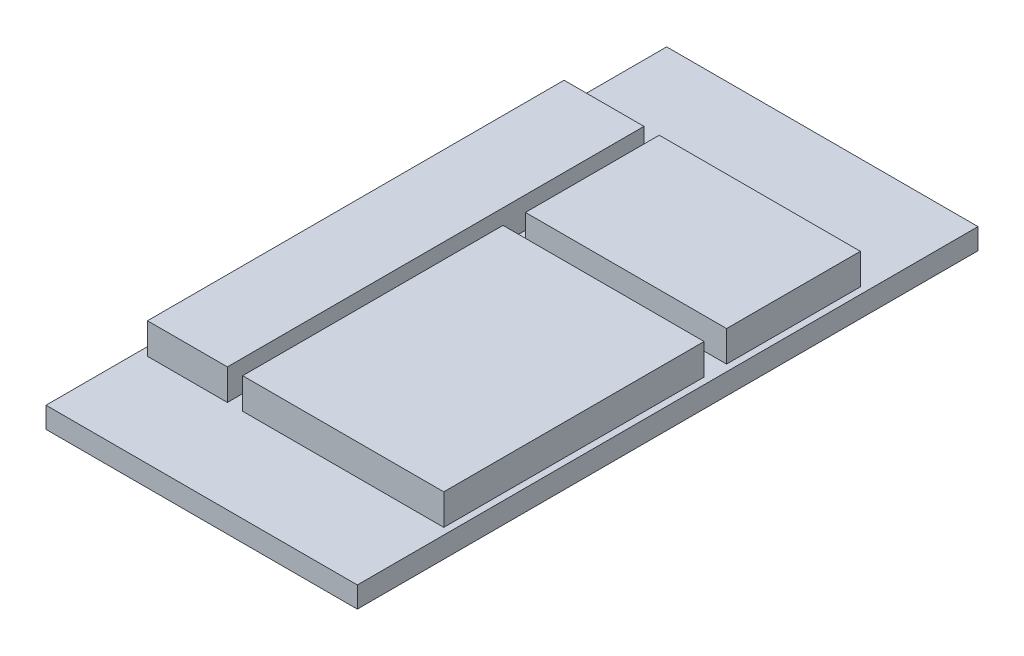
ISO-10303-21;
HEADER;
FILE_DESCRIPTION(('STEP AP214'),'2;1');
FILE_NAME('part.step','',(''),(''),'','','');
FILE_SCHEMA(('AUTOMOTIVE_DESIGN { 1 0 10303 214 1 1 1 1 }'));
ENDSEC;
DATA;
#1=APPLICATION_CONTEXT('core data for automotive mechanical design processes');
#2=APPLICATION_PROTOCOL_DEFINITION('international standard','automotive_design',2000,#1);
#3=PRODUCT_CONTEXT('',#1,'mechanical');
#4=PRODUCT('Part','Part','',(#3));
#5=PRODUCT_RELATED_PRODUCT_CATEGORY('part','',(#4));
#6=PRODUCT_DEFINITION_FORMATION('','',#4);
#7=PRODUCT_DEFINITION_CONTEXT('part definition',#1,'design');
#8=PRODUCT_DEFINITION('design','',#6,#7);
#9=PRODUCT_DEFINITION_SHAPE('','',#8);
#10=(LENGTH_UNIT() NAMED_UNIT(*) SI_UNIT(.MILLI.,.METRE.));
#11=(NAMED_UNIT(*) PLANE_ANGLE_UNIT() SI_UNIT($,.RADIAN.));
#12=(NAMED_UNIT(*) SI_UNIT($,.STERADIAN.) SOLID_ANGLE_UNIT());
#13=UNCERTAINTY_MEASURE_WITH_UNIT(LENGTH_MEASURE(1.E-05),#10,'distance_accuracy_value','');
#14=(GEOMETRIC_REPRESENTATION_CONTEXT(3) GLOBAL_UNCERTAINTY_ASSIGNED_CONTEXT((#13)) GLOBAL_UNIT_ASSIGNED_CONTEXT((#10,
#11,#12)) REPRESENTATION_CONTEXT('',''));
#15=CARTESIAN_POINT('',(0.,0.,0.));
#16=DIRECTION('',(0.,0.,1.));
#17=DIRECTION('',(1.,0.,0.));
#18=AXIS2_PLACEMENT_3D('',#15,#16,#17);
#19=CARTESIAN_POINT('',(0.,1.6,0.));
#20=DIRECTION('',(0.,-1.,0.));
#21=DIRECTION('',(0.,0.,-1.));
#22=AXIS2_PLACEMENT_3D('',#19,#20,#21);
#23=PLANE('',#22);
#24=DIRECTION('',(0.,0.,1.));
#25=VECTOR('',#24,1.);
#26=CARTESIAN_POINT('',(0.642334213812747,1.6,-7.09996877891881));
#27=LINE('',#26,#25);
#28=CARTESIAN_POINT('',(0.642334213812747,1.6,-38.8801939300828));
#29=VERTEX_POINT('',#28);
#30=CARTESIAN_POINT('',(0.642334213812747,1.6,-7.09996877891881));
#31=VERTEX_POINT('',#30);
#32=EDGE_CURVE('E149',#29,#31,#27,.T.);
#33=ORIENTED_EDGE('',*,*,#32,.F.);
#34=DIRECTION('',(-1.,0.,0.));
#35=VECTOR('',#34,1.);
#36=CARTESIAN_POINT('',(0.642334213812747,1.6,-38.8801939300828));
#37=LINE('',#36,#35);
#38=CARTESIAN_POINT('',(6.73811015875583,1.6,-38.8801939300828));
#39=VERTEX_POINT('',#38);
#40=EDGE_CURVE('E152',#39,#29,#37,.T.);
#41=ORIENTED_EDGE('',*,*,#40,.F.);
#42=DIRECTION('',(0.,0.,-1.));
#43=VECTOR('',#42,1.);
#44=CARTESIAN_POINT('',(6.73811015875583,1.6,-7.09996877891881));
#45=LINE('',#44,#43);
#46=CARTESIAN_POINT('',(6.73811015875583,1.6,-7.09996877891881));
#47=VERTEX_POINT('',#46);
#48=EDGE_CURVE('E171',#47,#39,#45,.T.);
#49=ORIENTED_EDGE('',*,*,#48,.F.);
#50=DIRECTION('',(1.,0.,0.));
#51=VECTOR('',#50,1.);
#52=CARTESIAN_POINT('',(0.642334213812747,1.6,-7.09996877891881));
#53=LINE('',#52,#51);
#54=EDGE_CURVE('E155',#31,#47,#53,.T.);
#55=ORIENTED_EDGE('',*,*,#54,.F.);
#56=EDGE_LOOP('',(#33,#41,#49,#55));
#57=FACE_BOUND('',#56,.T.);
#58=DIRECTION('',(0.,0.,1.));
#59=VECTOR('',#58,1.);
#60=CARTESIAN_POINT('',(0.,1.6,0.));
#61=LINE('',#60,#59);
#62=CARTESIAN_POINT('',(0.,1.6,-47.35));
#63=VERTEX_POINT('',#62);
#64=CARTESIAN_POINT('',(0.,1.6,0.));
#65=VERTEX_POINT('',#64);
#66=EDGE_CURVE('E252',#63,#65,#61,.T.);
#67=ORIENTED_EDGE('',*,*,#66,.T.);
#68=DIRECTION('',(1.,0.,0.));
#69=VECTOR('',#68,1.);
#70=CARTESIAN_POINT('',(0.,1.6,0.));
#71=LINE('',#70,#69);
#72=CARTESIAN_POINT('',(23.75,1.6,0.));
#73=VERTEX_POINT('',#72);
#74=EDGE_CURVE('E255',#65,#73,#71,.T.);
#75=ORIENTED_EDGE('',*,*,#74,.T.);
#76=DIRECTION('',(0.,0.,-1.));
#77=VECTOR('',#76,1.);
#78=CARTESIAN_POINT('',(23.75,1.6,0.));
#79=LINE('',#78,#77);
#80=CARTESIAN_POINT('',(23.75,1.6,-47.35));
#81=VERTEX_POINT('',#80);
#82=EDGE_CURVE('E258',#73,#81,#79,.T.);
#83=ORIENTED_EDGE('',*,*,#82,.T.);
#84=DIRECTION('',(-1.,0.,0.));
#85=VECTOR('',#84,1.);
#86=CARTESIAN_POINT('',(0.,1.6,-47.35));
#87=LINE('',#86,#85);
#88=EDGE_CURVE('E260',#81,#63,#87,.T.);
#89=ORIENTED_EDGE('',*,*,#88,.T.);
#90=EDGE_LOOP('',(#67,#75,#83,#89));
#91=FACE_BOUND('',#90,.T.);
#92=DIRECTION('',(0.,0.,-1.));
#93=VECTOR('',#92,1.);
#94=CARTESIAN_POINT('',(23.2446495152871,1.6,-7.09996877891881));
#95=LINE('',#94,#93);
#96=CARTESIAN_POINT('',(23.2446495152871,1.6,-7.09996877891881));
#97=VERTEX_POINT('',#96);
#98=CARTESIAN_POINT('',(23.2446495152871,1.6,-26.9626094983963));
#99=VERTEX_POINT('',#98);
#100=EDGE_CURVE('E160',#97,#99,#95,.T.);
#101=ORIENTED_EDGE('',*,*,#100,.F.);
#102=DIRECTION('',(1.,0.,0.));
#103=VECTOR('',#102,1.);
#104=CARTESIAN_POINT('',(23.2446495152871,1.6,-7.09996877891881));
#105=LINE('',#104,#103);
#106=CARTESIAN_POINT('',(7.90247185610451,1.6,-7.09996877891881));
#107=VERTEX_POINT('',#106);
#108=EDGE_CURVE('E223',#107,#97,#105,.T.);
#109=ORIENTED_EDGE('',*,*,#108,.F.);
#110=DIRECTION('',(0.,0.,1.));
#111=VECTOR('',#110,1.);
#112=CARTESIAN_POINT('',(7.90247185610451,1.6,-7.09996877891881));
#113=LINE('',#112,#111);
#114=CARTESIAN_POINT('',(7.90247185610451,1.6,-26.9626094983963));
#115=VERTEX_POINT('',#114);
#116=EDGE_CURVE('E235',#115,#107,#113,.T.);
#117=ORIENTED_EDGE('',*,*,#116,.F.);
#118=DIRECTION('',(-1.,0.,0.));
#119=VECTOR('',#118,1.);
#120=CARTESIAN_POINT('',(23.2446495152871,1.6,-26.9626094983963));
#121=LINE('',#120,#119);
#122=EDGE_CURVE('E232',#99,#115,#121,.T.);
#123=ORIENTED_EDGE('',*,*,#122,.F.);
#124=EDGE_LOOP('',(#101,#109,#117,#123));
#125=FACE_BOUND('',#124,.T.);
#126=DIRECTION('',(0.,0.,1.));
#127=VECTOR('',#126,1.);
#128=CARTESIAN_POINT('',(7.90247185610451,1.6,-38.8801939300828));
#129=LINE('',#128,#127);
#130=CARTESIAN_POINT('',(7.90247185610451,1.6,-38.8801939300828));
#131=VERTEX_POINT('',#130);
#132=CARTESIAN_POINT('',(7.90247185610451,1.6,-28.6749061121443));
#133=VERTEX_POINT('',#132);
#134=EDGE_CURVE('E208',#131,#133,#129,.T.);
#135=ORIENTED_EDGE('',*,*,#134,.F.);
#136=DIRECTION('',(-1.,0.,0.));
#137=VECTOR('',#136,1.);
#138=CARTESIAN_POINT('',(7.90247185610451,1.6,-38.8801939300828));
#139=LINE('',#138,#137);
#140=CARTESIAN_POINT('',(23.2446495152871,1.6,-38.8801939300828));
#141=VERTEX_POINT('',#140);
#142=EDGE_CURVE('E202',#141,#131,#139,.T.);
#143=ORIENTED_EDGE('',*,*,#142,.F.);
#144=DIRECTION('',(0.,0.,-1.));
#145=VECTOR('',#144,1.);
#146=CARTESIAN_POINT('',(23.2446495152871,1.6,-38.8801939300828));
#147=LINE('',#146,#145);
#148=CARTESIAN_POINT('',(23.2446495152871,1.6,-28.6749061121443));
#149=VERTEX_POINT('',#148);
#150=EDGE_CURVE('E59',#149,#141,#147,.T.);
#151=ORIENTED_EDGE('',*,*,#150,.F.);
#152=DIRECTION('',(1.,0.,0.));
#153=VECTOR('',#152,1.);
#154=CARTESIAN_POINT('',(7.90247185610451,1.6,-28.6749061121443));
#155=LINE('',#154,#153);
#156=EDGE_CURVE('E54',#133,#149,#155,.T.);
#157=ORIENTED_EDGE('',*,*,#156,.F.);
#158=EDGE_LOOP('',(#135,#143,#151,#157));
#159=FACE_BOUND('',#158,.T.);
#160=ADVANCED_FACE('F39',(#57,#91,#125,#159),#23,.F.);
#161=CARTESIAN_POINT('',(0.,1.6,0.));
#162=DIRECTION('',(1.,0.,0.));
#163=DIRECTION('',(0.,0.,-1.));
#164=AXIS2_PLACEMENT_3D('',#161,#162,#163);
#165=PLANE('',#164);
#166=DIRECTION('',(0.,0.,1.));
#167=VECTOR('',#166,1.);
#168=CARTESIAN_POINT('',(0.,0.,0.));
#169=LINE('',#168,#167);
#170=CARTESIAN_POINT('',(0.,0.,-47.35));
#171=VERTEX_POINT('',#170);
#172=CARTESIAN_POINT('',(0.,0.,0.));
#173=VERTEX_POINT('',#172);
#174=EDGE_CURVE('E251',#171,#173,#169,.T.);
#175=ORIENTED_EDGE('',*,*,#174,.T.);
#176=DIRECTION('',(0.,-1.,0.));
#177=VECTOR('',#176,1.);
#178=CARTESIAN_POINT('',(0.,1.6,0.));
#179=LINE('',#178,#177);
#180=EDGE_CURVE('E11',#65,#173,#179,.T.);
#181=ORIENTED_EDGE('',*,*,#180,.F.);
#182=ORIENTED_EDGE('',*,*,#66,.F.);
#183=DIRECTION('',(0.,-1.,0.));
#184=VECTOR('',#183,1.);
#185=CARTESIAN_POINT('',(0.,1.6,-47.35));
#186=LINE('',#185,#184);
#187=EDGE_CURVE('E262',#63,#171,#186,.T.);
#188=ORIENTED_EDGE('',*,*,#187,.T.);
#189=EDGE_LOOP('',(#175,#181,#182,#188));
#190=FACE_BOUND('',#189,.T.);
#191=ADVANCED_FACE('F41',(#190),#165,.F.);
#192=CARTESIAN_POINT('',(0.,1.6,0.));
#193=DIRECTION('',(0.,0.,-1.));
#194=DIRECTION('',(-1.,0.,0.));
#195=AXIS2_PLACEMENT_3D('',#192,#193,#194);
#196=PLANE('',#195);
#197=DIRECTION('',(1.,0.,0.));
#198=VECTOR('',#197,1.);
#199=CARTESIAN_POINT('',(0.,0.,0.));
#200=LINE('',#199,#198);
#201=CARTESIAN_POINT('',(23.75,0.,0.));
#202=VERTEX_POINT('',#201);
#203=EDGE_CURVE('E265',#173,#202,#200,.T.);
#204=ORIENTED_EDGE('',*,*,#203,.T.);
#205=DIRECTION('',(0.,-1.,0.));
#206=VECTOR('',#205,1.);
#207=CARTESIAN_POINT('',(23.75,1.6,0.));
#208=LINE('',#207,#206);
#209=EDGE_CURVE('E47',#73,#202,#208,.T.);
#210=ORIENTED_EDGE('',*,*,#209,.F.);
#211=ORIENTED_EDGE('',*,*,#74,.F.);
#212=ORIENTED_EDGE('',*,*,#180,.T.);
#213=EDGE_LOOP('',(#204,#210,#211,#212));
#214=FACE_BOUND('',#213,.T.);
#215=ADVANCED_FACE('F294',(#214),#196,.F.);
#216=CARTESIAN_POINT('',(23.75,1.6,0.));
#217=DIRECTION('',(-1.,0.,0.));
#218=DIRECTION('',(0.,0.,1.));
#219=AXIS2_PLACEMENT_3D('',#216,#217,#218);
#220=PLANE('',#219);
#221=DIRECTION('',(0.,0.,-1.));
#222=VECTOR('',#221,1.);
#223=CARTESIAN_POINT('',(23.75,0.,0.));
#224=LINE('',#223,#222);
#225=CARTESIAN_POINT('',(23.75,0.,-47.35));
#226=VERTEX_POINT('',#225);
#227=EDGE_CURVE('E267',#202,#226,#224,.T.);
#228=ORIENTED_EDGE('',*,*,#227,.T.);
#229=DIRECTION('',(0.,-1.,0.));
#230=VECTOR('',#229,1.);
#231=CARTESIAN_POINT('',(23.75,1.6,-47.35));
#232=LINE('',#231,#230);
#233=EDGE_CURVE('E272',#81,#226,#232,.T.);
#234=ORIENTED_EDGE('',*,*,#233,.F.);
#235=ORIENTED_EDGE('',*,*,#82,.F.);
#236=ORIENTED_EDGE('',*,*,#209,.T.);
#237=EDGE_LOOP('',(#228,#234,#235,#236));
#238=FACE_BOUND('',#237,.T.);
#239=ADVANCED_FACE('F279',(#238),#220,.F.);
#240=CARTESIAN_POINT('',(0.,1.6,-47.35));
#241=DIRECTION('',(0.,0.,1.));
#242=DIRECTION('',(1.,0.,0.));
#243=AXIS2_PLACEMENT_3D('',#240,#241,#242);
#244=PLANE('',#243);
#245=DIRECTION('',(-1.,0.,0.));
#246=VECTOR('',#245,1.);
#247=CARTESIAN_POINT('',(0.,0.,-47.35));
#248=LINE('',#247,#246);
#249=EDGE_CURVE('E256',#226,#171,#248,.T.);
#250=ORIENTED_EDGE('',*,*,#249,.T.);
#251=ORIENTED_EDGE('',*,*,#187,.F.);
#252=ORIENTED_EDGE('',*,*,#88,.F.);
#253=ORIENTED_EDGE('',*,*,#233,.T.);
#254=EDGE_LOOP('',(#250,#251,#252,#253));
#255=FACE_BOUND('',#254,.T.);
#256=ADVANCED_FACE('F288',(#255),#244,.F.);
#257=CARTESIAN_POINT('',(0.,0.,0.));
#258=DIRECTION('',(0.,-1.,0.));
#259=DIRECTION('',(0.,0.,-1.));
#260=AXIS2_PLACEMENT_3D('',#257,#258,#259);
#261=PLANE('',#260);
#262=ORIENTED_EDGE('',*,*,#174,.F.);
#263=ORIENTED_EDGE('',*,*,#249,.F.);
#264=ORIENTED_EDGE('',*,*,#227,.F.);
#265=ORIENTED_EDGE('',*,*,#203,.F.);
#266=EDGE_LOOP('',(#262,#263,#264,#265));
#267=FACE_BOUND('',#266,.T.);
#268=ADVANCED_FACE('F285',(#267),#261,.T.);
#269=CARTESIAN_POINT('',(23.2446495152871,3.95,-7.09996877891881));
#270=DIRECTION('',(-1.,0.,0.));
#271=DIRECTION('',(0.,0.,1.));
#272=AXIS2_PLACEMENT_3D('',#269,#270,#271);
#273=PLANE('',#272);
#274=ORIENTED_EDGE('',*,*,#100,.T.);
#275=DIRECTION('',(0.,-1.,0.));
#276=VECTOR('',#275,1.);
#277=CARTESIAN_POINT('',(23.2446495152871,3.95,-26.9626094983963));
#278=LINE('',#277,#276);
#279=CARTESIAN_POINT('',(23.2446495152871,3.95,-26.9626094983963));
#280=VERTEX_POINT('',#279);
#281=EDGE_CURVE('E248',#280,#99,#278,.T.);
#282=ORIENTED_EDGE('',*,*,#281,.F.);
#283=DIRECTION('',(0.,0.,-1.));
#284=VECTOR('',#283,1.);
#285=CARTESIAN_POINT('',(23.2446495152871,3.95,-7.09996877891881));
#286=LINE('',#285,#284);
#287=CARTESIAN_POINT('',(23.2446495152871,3.95,-7.09996877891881));
#288=VERTEX_POINT('',#287);
#289=EDGE_CURVE('E219',#288,#280,#286,.T.);
#290=ORIENTED_EDGE('',*,*,#289,.F.);
#291=DIRECTION('',(0.,-1.,0.));
#292=VECTOR('',#291,1.);
#293=CARTESIAN_POINT('',(23.2446495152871,3.95,-7.09996877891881));
#294=LINE('',#293,#292);
#295=EDGE_CURVE('E229',#288,#97,#294,.T.);
#296=ORIENTED_EDGE('',*,*,#295,.T.);
#297=EDGE_LOOP('',(#274,#282,#290,#296));
#298=FACE_BOUND('',#297,.T.);
#299=ADVANCED_FACE('F309',(#298),#273,.F.);
#300=CARTESIAN_POINT('',(23.2446495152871,3.95,-26.9626094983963));
#301=DIRECTION('',(0.,0.,1.));
#302=DIRECTION('',(1.,0.,0.));
#303=AXIS2_PLACEMENT_3D('',#300,#301,#302);
#304=PLANE('',#303);
#305=ORIENTED_EDGE('',*,*,#122,.T.);
#306=DIRECTION('',(0.,-1.,0.));
#307=VECTOR('',#306,1.);
#308=CARTESIAN_POINT('',(7.90247185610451,3.95,-26.9626094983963));
#309=LINE('',#308,#307);
#310=CARTESIAN_POINT('',(7.90247185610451,3.95,-26.9626094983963));
#311=VERTEX_POINT('',#310);
#312=EDGE_CURVE('E245',#311,#115,#309,.T.);
#313=ORIENTED_EDGE('',*,*,#312,.F.);
#314=DIRECTION('',(-1.,0.,0.));
#315=VECTOR('',#314,1.);
#316=CARTESIAN_POINT('',(23.2446495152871,3.95,-26.9626094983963));
#317=LINE('',#316,#315);
#318=EDGE_CURVE('E222',#280,#311,#317,.T.);
#319=ORIENTED_EDGE('',*,*,#318,.F.);
#320=ORIENTED_EDGE('',*,*,#281,.T.);
#321=EDGE_LOOP('',(#305,#313,#319,#320));
#322=FACE_BOUND('',#321,.T.);
#323=ADVANCED_FACE('F335',(#322),#304,.F.);
#324=CARTESIAN_POINT('',(7.90247185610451,3.95,-7.09996877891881));
#325=DIRECTION('',(1.,0.,0.));
#326=DIRECTION('',(0.,0.,-1.));
#327=AXIS2_PLACEMENT_3D('',#324,#325,#326);
#328=PLANE('',#327);
#329=ORIENTED_EDGE('',*,*,#116,.T.);
#330=DIRECTION('',(0.,-1.,0.));
#331=VECTOR('',#330,1.);
#332=CARTESIAN_POINT('',(7.90247185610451,3.95,-7.09996877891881));
#333=LINE('',#332,#331);
#334=CARTESIAN_POINT('',(7.90247185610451,3.95,-7.09996877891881));
#335=VERTEX_POINT('',#334);
#336=EDGE_CURVE('E242',#335,#107,#333,.T.);
#337=ORIENTED_EDGE('',*,*,#336,.F.);
#338=DIRECTION('',(0.,0.,1.));
#339=VECTOR('',#338,1.);
#340=CARTESIAN_POINT('',(7.90247185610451,3.95,-7.09996877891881));
#341=LINE('',#340,#339);
#342=EDGE_CURVE('E225',#311,#335,#341,.T.);
#343=ORIENTED_EDGE('',*,*,#342,.F.);
#344=ORIENTED_EDGE('',*,*,#312,.T.);
#345=EDGE_LOOP('',(#329,#337,#343,#344));
#346=FACE_BOUND('',#345,.T.);
#347=ADVANCED_FACE('F344',(#346),#328,.F.);
#348=CARTESIAN_POINT('',(23.2446495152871,3.95,-7.09996877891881));
#349=DIRECTION('',(0.,0.,-1.));
#350=DIRECTION('',(-1.,0.,0.));
#351=AXIS2_PLACEMENT_3D('',#348,#349,#350);
#352=PLANE('',#351);
#353=ORIENTED_EDGE('',*,*,#108,.T.);
#354=ORIENTED_EDGE('',*,*,#295,.F.);
#355=DIRECTION('',(1.,0.,0.));
#356=VECTOR('',#355,1.);
#357=CARTESIAN_POINT('',(23.2446495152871,3.95,-7.09996877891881));
#358=LINE('',#357,#356);
#359=EDGE_CURVE('E227',#335,#288,#358,.T.);
#360=ORIENTED_EDGE('',*,*,#359,.F.);
#361=ORIENTED_EDGE('',*,*,#336,.T.);
#362=EDGE_LOOP('',(#353,#354,#360,#361));
#363=FACE_BOUND('',#362,.T.);
#364=ADVANCED_FACE('F353',(#363),#352,.F.);
#365=CARTESIAN_POINT('',(0.,3.95,0.));
#366=DIRECTION('',(0.,1.,0.));
#367=DIRECTION('',(0.,0.,1.));
#368=AXIS2_PLACEMENT_3D('',#365,#366,#367);
#369=PLANE('',#368);
#370=ORIENTED_EDGE('',*,*,#289,.T.);
#371=ORIENTED_EDGE('',*,*,#318,.T.);
#372=ORIENTED_EDGE('',*,*,#342,.T.);
#373=ORIENTED_EDGE('',*,*,#359,.T.);
#374=EDGE_LOOP('',(#370,#371,#372,#373));
#375=FACE_BOUND('',#374,.T.);
#376=ADVANCED_FACE('F363',(#375),#369,.T.);
#377=CARTESIAN_POINT('',(0.642334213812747,3.95,-7.09996877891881));
#378=DIRECTION('',(1.,0.,0.));
#379=DIRECTION('',(0.,0.,-1.));
#380=AXIS2_PLACEMENT_3D('',#377,#378,#379);
#381=PLANE('',#380);
#382=ORIENTED_EDGE('',*,*,#32,.T.);
#383=DIRECTION('',(0.,-1.,0.));
#384=VECTOR('',#383,1.);
#385=CARTESIAN_POINT('',(0.642334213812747,3.95,-7.09996877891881));
#386=LINE('',#385,#384);
#387=CARTESIAN_POINT('',(0.642334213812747,3.95,-7.09996877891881));
#388=VERTEX_POINT('',#387);
#389=EDGE_CURVE('E211',#388,#31,#386,.T.);
#390=ORIENTED_EDGE('',*,*,#389,.F.);
#391=DIRECTION('',(0.,0.,1.));
#392=VECTOR('',#391,1.);
#393=CARTESIAN_POINT('',(0.642334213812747,3.95,-7.09996877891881));
#394=LINE('',#393,#392);
#395=CARTESIAN_POINT('',(0.642334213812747,3.95,-38.8801939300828));
#396=VERTEX_POINT('',#395);
#397=EDGE_CURVE('E172',#396,#388,#394,.T.);
#398=ORIENTED_EDGE('',*,*,#397,.F.);
#399=DIRECTION('',(0.,-1.,0.));
#400=VECTOR('',#399,1.);
#401=CARTESIAN_POINT('',(0.642334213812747,3.95,-38.8801939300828));
#402=LINE('',#401,#400);
#403=EDGE_CURVE('E167',#396,#29,#402,.T.);
#404=ORIENTED_EDGE('',*,*,#403,.T.);
#405=EDGE_LOOP('',(#382,#390,#398,#404));
#406=FACE_BOUND('',#405,.T.);
#407=ADVANCED_FACE('F174',(#406),#381,.F.);
#408=CARTESIAN_POINT('',(0.642334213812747,3.95,-7.09996877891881));
#409=DIRECTION('',(0.,0.,-1.));
#410=DIRECTION('',(-1.,0.,0.));
#411=AXIS2_PLACEMENT_3D('',#408,#409,#410);
#412=PLANE('',#411);
#413=ORIENTED_EDGE('',*,*,#54,.T.);
#414=DIRECTION('',(0.,-1.,0.));
#415=VECTOR('',#414,1.);
#416=CARTESIAN_POINT('',(6.73811015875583,3.95,-7.09996877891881));
#417=LINE('',#416,#415);
#418=CARTESIAN_POINT('',(6.73811015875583,3.95,-7.09996877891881));
#419=VERTEX_POINT('',#418);
#420=EDGE_CURVE('E180',#419,#47,#417,.T.);
#421=ORIENTED_EDGE('',*,*,#420,.F.);
#422=DIRECTION('',(1.,0.,0.));
#423=VECTOR('',#422,1.);
#424=CARTESIAN_POINT('',(0.642334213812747,3.95,-7.09996877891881));
#425=LINE('',#424,#423);
#426=EDGE_CURVE('E187',#388,#419,#425,.T.);
#427=ORIENTED_EDGE('',*,*,#426,.F.);
#428=ORIENTED_EDGE('',*,*,#389,.T.);
#429=EDGE_LOOP('',(#413,#421,#427,#428));
#430=FACE_BOUND('',#429,.T.);
#431=ADVANCED_FACE('F382',(#430),#412,.F.);
#432=CARTESIAN_POINT('',(6.73811015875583,3.95,-7.09996877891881));
#433=DIRECTION('',(-1.,0.,0.));
#434=DIRECTION('',(0.,0.,1.));
#435=AXIS2_PLACEMENT_3D('',#432,#433,#434);
#436=PLANE('',#435);
#437=ORIENTED_EDGE('',*,*,#48,.T.);
#438=DIRECTION('',(0.,-1.,0.));
#439=VECTOR('',#438,1.);
#440=CARTESIAN_POINT('',(6.73811015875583,3.95,-38.8801939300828));
#441=LINE('',#440,#439);
#442=CARTESIAN_POINT('',(6.73811015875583,3.95,-38.8801939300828));
#443=VERTEX_POINT('',#442);
#444=EDGE_CURVE('E170',#443,#39,#441,.T.);
#445=ORIENTED_EDGE('',*,*,#444,.F.);
#446=DIRECTION('',(0.,0.,-1.));
#447=VECTOR('',#446,1.);
#448=CARTESIAN_POINT('',(6.73811015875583,3.95,-7.09996877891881));
#449=LINE('',#448,#447);
#450=EDGE_CURVE('E178',#419,#443,#449,.T.);
#451=ORIENTED_EDGE('',*,*,#450,.F.);
#452=ORIENTED_EDGE('',*,*,#420,.T.);
#453=EDGE_LOOP('',(#437,#445,#451,#452));
#454=FACE_BOUND('',#453,.T.);
#455=ADVANCED_FACE('F391',(#454),#436,.F.);
#456=CARTESIAN_POINT('',(0.642334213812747,3.95,-38.8801939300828));
#457=DIRECTION('',(0.,0.,1.));
#458=DIRECTION('',(1.,0.,0.));
#459=AXIS2_PLACEMENT_3D('',#456,#457,#458);
#460=PLANE('',#459);
#461=ORIENTED_EDGE('',*,*,#40,.T.);
#462=ORIENTED_EDGE('',*,*,#403,.F.);
#463=DIRECTION('',(-1.,0.,0.));
#464=VECTOR('',#463,1.);
#465=CARTESIAN_POINT('',(0.642334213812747,3.95,-38.8801939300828));
#466=LINE('',#465,#464);
#467=EDGE_CURVE('E176',#443,#396,#466,.T.);
#468=ORIENTED_EDGE('',*,*,#467,.F.);
#469=ORIENTED_EDGE('',*,*,#444,.T.);
#470=EDGE_LOOP('',(#461,#462,#468,#469));
#471=FACE_BOUND('',#470,.T.);
#472=ADVANCED_FACE('F165',(#471),#460,.F.);
#473=CARTESIAN_POINT('',(0.,3.95,0.));
#474=DIRECTION('',(0.,-1.,0.));
#475=DIRECTION('',(0.,0.,-1.));
#476=AXIS2_PLACEMENT_3D('',#473,#474,#475);
#477=PLANE('',#476);
#478=ORIENTED_EDGE('',*,*,#397,.T.);
#479=ORIENTED_EDGE('',*,*,#426,.T.);
#480=ORIENTED_EDGE('',*,*,#450,.T.);
#481=ORIENTED_EDGE('',*,*,#467,.T.);
#482=EDGE_LOOP('',(#478,#479,#480,#481));
#483=FACE_BOUND('',#482,.T.);
#484=ADVANCED_FACE('F410',(#483),#477,.F.);
#485=CARTESIAN_POINT('',(7.90247185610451,3.95,-38.8801939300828));
#486=DIRECTION('',(1.,0.,0.));
#487=DIRECTION('',(0.,0.,-1.));
#488=AXIS2_PLACEMENT_3D('',#485,#486,#487);
#489=PLANE('',#488);
#490=ORIENTED_EDGE('',*,*,#134,.T.);
#491=DIRECTION('',(0.,-1.,0.));
#492=VECTOR('',#491,1.);
#493=CARTESIAN_POINT('',(7.90247185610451,3.95,-28.6749061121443));
#494=LINE('',#493,#492);
#495=CARTESIAN_POINT('',(7.90247185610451,3.95,-28.6749061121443));
#496=VERTEX_POINT('',#495);
#497=EDGE_CURVE('E190',#496,#133,#494,.T.);
#498=ORIENTED_EDGE('',*,*,#497,.F.);
#499=DIRECTION('',(0.,0.,1.));
#500=VECTOR('',#499,1.);
#501=CARTESIAN_POINT('',(7.90247185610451,3.95,-38.8801939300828));
#502=LINE('',#501,#500);
#503=CARTESIAN_POINT('',(7.90247185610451,3.95,-38.8801939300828));
#504=VERTEX_POINT('',#503);
#505=EDGE_CURVE('E205',#504,#496,#502,.T.);
#506=ORIENTED_EDGE('',*,*,#505,.F.);
#507=DIRECTION('',(0.,-1.,0.));
#508=VECTOR('',#507,1.);
#509=CARTESIAN_POINT('',(7.90247185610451,3.95,-38.8801939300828));
#510=LINE('',#509,#508);
#511=EDGE_CURVE('E198',#504,#131,#510,.T.);
#512=ORIENTED_EDGE('',*,*,#511,.T.);
#513=EDGE_LOOP('',(#490,#498,#506,#512));
#514=FACE_BOUND('',#513,.T.);
#515=ADVANCED_FACE('F419',(#514),#489,.F.);
#516=CARTESIAN_POINT('',(7.90247185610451,3.95,-28.6749061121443));
#517=DIRECTION('',(0.,0.,-1.));
#518=DIRECTION('',(-1.,0.,0.));
#519=AXIS2_PLACEMENT_3D('',#516,#517,#518);
#520=PLANE('',#519);
#521=ORIENTED_EDGE('',*,*,#156,.T.);
#522=DIRECTION('',(0.,-1.,0.));
#523=VECTOR('',#522,1.);
#524=CARTESIAN_POINT('',(23.2446495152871,3.95,-28.6749061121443));
#525=LINE('',#524,#523);
#526=CARTESIAN_POINT('',(23.2446495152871,3.95,-28.6749061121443));
#527=VERTEX_POINT('',#526);
#528=EDGE_CURVE('E192',#527,#149,#525,.T.);
#529=ORIENTED_EDGE('',*,*,#528,.F.);
#530=DIRECTION('',(1.,0.,0.));
#531=VECTOR('',#530,1.);
#532=CARTESIAN_POINT('',(7.90247185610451,3.95,-28.6749061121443));
#533=LINE('',#532,#531);
#534=EDGE_CURVE('E215',#496,#527,#533,.T.);
#535=ORIENTED_EDGE('',*,*,#534,.F.);
#536=ORIENTED_EDGE('',*,*,#497,.T.);
#537=EDGE_LOOP('',(#521,#529,#535,#536));
#538=FACE_BOUND('',#537,.T.);
#539=ADVANCED_FACE('F429',(#538),#520,.F.);
#540=CARTESIAN_POINT('',(23.2446495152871,3.95,-38.8801939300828));
#541=DIRECTION('',(-1.,0.,0.));
#542=DIRECTION('',(0.,0.,1.));
#543=AXIS2_PLACEMENT_3D('',#540,#541,#542);
#544=PLANE('',#543);
#545=ORIENTED_EDGE('',*,*,#150,.T.);
#546=DIRECTION('',(0.,-1.,0.));
#547=VECTOR('',#546,1.);
#548=CARTESIAN_POINT('',(23.2446495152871,3.95,-38.8801939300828));
#549=LINE('',#548,#547);
#550=CARTESIAN_POINT('',(23.2446495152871,3.95,-38.8801939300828));
#551=VERTEX_POINT('',#550);
#552=EDGE_CURVE('E195',#551,#141,#549,.T.);
#553=ORIENTED_EDGE('',*,*,#552,.F.);
#554=DIRECTION('',(0.,0.,-1.));
#555=VECTOR('',#554,1.);
#556=CARTESIAN_POINT('',(23.2446495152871,3.95,-38.8801939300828));
#557=LINE('',#556,#555);
#558=EDGE_CURVE('E213',#527,#551,#557,.T.);
#559=ORIENTED_EDGE('',*,*,#558,.F.);
#560=ORIENTED_EDGE('',*,*,#528,.T.);
#561=EDGE_LOOP('',(#545,#553,#559,#560));
#562=FACE_BOUND('',#561,.T.);
#563=ADVANCED_FACE('F439',(#562),#544,.F.);
#564=CARTESIAN_POINT('',(7.90247185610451,3.95,-38.8801939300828));
#565=DIRECTION('',(0.,0.,1.));
#566=DIRECTION('',(1.,0.,0.));
#567=AXIS2_PLACEMENT_3D('',#564,#565,#566);
#568=PLANE('',#567);
#569=ORIENTED_EDGE('',*,*,#142,.T.);
#570=ORIENTED_EDGE('',*,*,#511,.F.);
#571=DIRECTION('',(-1.,0.,0.));
#572=VECTOR('',#571,1.);
#573=CARTESIAN_POINT('',(7.90247185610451,3.95,-38.8801939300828));
#574=LINE('',#573,#572);
#575=EDGE_CURVE('E201',#551,#504,#574,.T.);
#576=ORIENTED_EDGE('',*,*,#575,.F.);
#577=ORIENTED_EDGE('',*,*,#552,.T.);
#578=EDGE_LOOP('',(#569,#570,#576,#577));
#579=FACE_BOUND('',#578,.T.);
#580=ADVANCED_FACE('F449',(#579),#568,.F.);
#581=CARTESIAN_POINT('',(0.,3.95,0.));
#582=DIRECTION('',(0.,1.,0.));
#583=DIRECTION('',(0.,0.,1.));
#584=AXIS2_PLACEMENT_3D('',#581,#582,#583);
#585=PLANE('',#584);
#586=ORIENTED_EDGE('',*,*,#505,.T.);
#587=ORIENTED_EDGE('',*,*,#534,.T.);
#588=ORIENTED_EDGE('',*,*,#558,.T.);
#589=ORIENTED_EDGE('',*,*,#575,.T.);
#590=EDGE_LOOP('',(#586,#587,#588,#589));
#591=FACE_BOUND('',#590,.T.);
#592=ADVANCED_FACE('F459',(#591),#585,.T.);
#593=CLOSED_SHELL('',(#160,#191,#215,#239,#256,#268,#299,#323,#347,#364,#376,#407,#431,#455,
#472,#484,#515,#539,#563,#580,#592));
#594=MANIFOLD_SOLID_BREP('B2',#593);
#595=ADVANCED_BREP_SHAPE_REPRESENTATION('',(#18,#594),#14);
#596=SHAPE_DEFINITION_REPRESENTATION(#9,#595);
ENDSEC;
END-ISO-10303-21;
